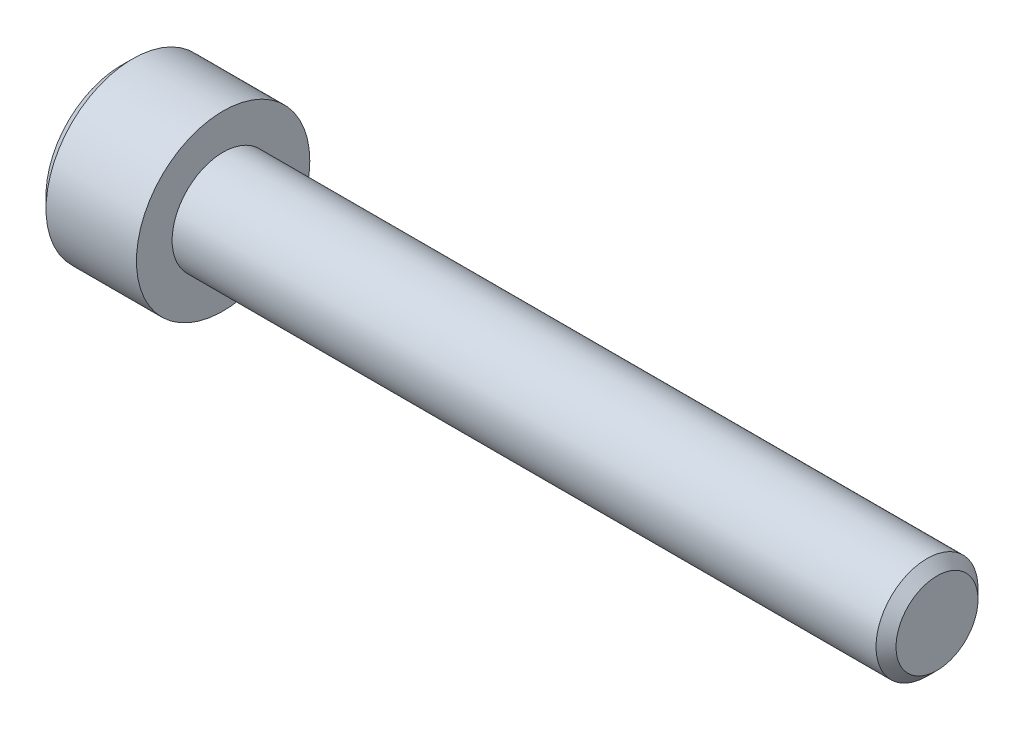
ISO-10303-21;
HEADER;
FILE_DESCRIPTION(('STEP AP214'),'2;1');
FILE_NAME('part.step','',(''),(''),'','','');
FILE_SCHEMA(('AUTOMOTIVE_DESIGN { 1 0 10303 214 1 1 1 1 }'));
ENDSEC;
DATA;
#1=APPLICATION_CONTEXT('core data for automotive mechanical design processes');
#2=APPLICATION_PROTOCOL_DEFINITION('international standard','automotive_design',2000,#1);
#3=PRODUCT_CONTEXT('',#1,'mechanical');
#4=PRODUCT('Part','Part','',(#3));
#5=PRODUCT_RELATED_PRODUCT_CATEGORY('part','',(#4));
#6=PRODUCT_DEFINITION_FORMATION('','',#4);
#7=PRODUCT_DEFINITION_CONTEXT('part definition',#1,'design');
#8=PRODUCT_DEFINITION('design','',#6,#7);
#9=PRODUCT_DEFINITION_SHAPE('','',#8);
#10=(LENGTH_UNIT() NAMED_UNIT(*) SI_UNIT(.MILLI.,.METRE.));
#11=(NAMED_UNIT(*) PLANE_ANGLE_UNIT() SI_UNIT($,.RADIAN.));
#12=(NAMED_UNIT(*) SI_UNIT($,.STERADIAN.) SOLID_ANGLE_UNIT());
#13=UNCERTAINTY_MEASURE_WITH_UNIT(LENGTH_MEASURE(1.E-05),#10,'distance_accuracy_value','');
#14=(GEOMETRIC_REPRESENTATION_CONTEXT(3) GLOBAL_UNCERTAINTY_ASSIGNED_CONTEXT((#13)) GLOBAL_UNIT_ASSIGNED_CONTEXT((#10,
#11,#12)) REPRESENTATION_CONTEXT('',''));
#15=CARTESIAN_POINT('',(0.,0.,0.));
#16=DIRECTION('',(0.,0.,1.));
#17=DIRECTION('',(1.,0.,0.));
#18=AXIS2_PLACEMENT_3D('',#15,#16,#17);
#19=CARTESIAN_POINT('',(-5.,0.,0.));
#20=DIRECTION('',(1.,0.,0.));
#21=DIRECTION('',(0.,0.,-1.));
#22=AXIS2_PLACEMENT_3D('',#19,#20,#21);
#23=PLANE('',#22);
#24=CARTESIAN_POINT('',(-5.,0.,0.));
#25=DIRECTION('',(1.,0.,0.));
#26=DIRECTION('',(0.,0.,-1.));
#27=AXIS2_PLACEMENT_3D('',#24,#25,#26);
#28=CIRCLE('',#27,3.68333333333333);
#29=CARTESIAN_POINT('',(-5.,0.,-3.68333333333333));
#30=VERTEX_POINT('',#29);
#31=EDGE_CURVE('E10',#30,#30,#28,.T.);
#32=ORIENTED_EDGE('',*,*,#31,.F.);
#33=EDGE_LOOP('',(#32));
#34=FACE_BOUND('',#33,.T.);
#35=DIRECTION('',(0.,0.5,-0.866025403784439));
#36=VECTOR('',#35,1.);
#37=CARTESIAN_POINT('',(-5.,-2.3094010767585,0.));
#38=LINE('',#37,#36);
#39=CARTESIAN_POINT('',(-5.,-2.3094010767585,0.));
#40=VERTEX_POINT('',#39);
#41=CARTESIAN_POINT('',(-5.,-1.15470053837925,-2.));
#42=VERTEX_POINT('',#41);
#43=EDGE_CURVE('E152',#40,#42,#38,.T.);
#44=ORIENTED_EDGE('',*,*,#43,.T.);
#45=DIRECTION('',(0.,1.,0.));
#46=VECTOR('',#45,1.);
#47=CARTESIAN_POINT('',(-5.,-1.15470053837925,-2.));
#48=LINE('',#47,#46);
#49=CARTESIAN_POINT('',(-5.,1.15470053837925,-2.));
#50=VERTEX_POINT('',#49);
#51=EDGE_CURVE('E154',#42,#50,#48,.T.);
#52=ORIENTED_EDGE('',*,*,#51,.T.);
#53=DIRECTION('',(0.,0.5,0.866025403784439));
#54=VECTOR('',#53,1.);
#55=CARTESIAN_POINT('',(-5.,1.15470053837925,-2.));
#56=LINE('',#55,#54);
#57=CARTESIAN_POINT('',(-5.,2.3094010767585,0.));
#58=VERTEX_POINT('',#57);
#59=EDGE_CURVE('E157',#50,#58,#56,.T.);
#60=ORIENTED_EDGE('',*,*,#59,.T.);
#61=DIRECTION('',(0.,-0.5,0.866025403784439));
#62=VECTOR('',#61,1.);
#63=CARTESIAN_POINT('',(-5.,2.3094010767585,0.));
#64=LINE('',#63,#62);
#65=CARTESIAN_POINT('',(-5.,1.15470053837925,2.));
#66=VERTEX_POINT('',#65);
#67=EDGE_CURVE('E99',#58,#66,#64,.T.);
#68=ORIENTED_EDGE('',*,*,#67,.T.);
#69=DIRECTION('',(0.,-1.,0.));
#70=VECTOR('',#69,1.);
#71=CARTESIAN_POINT('',(-5.,1.15470053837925,2.));
#72=LINE('',#71,#70);
#73=CARTESIAN_POINT('',(-5.,-1.15470053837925,2.));
#74=VERTEX_POINT('',#73);
#75=EDGE_CURVE('E159',#66,#74,#72,.T.);
#76=ORIENTED_EDGE('',*,*,#75,.T.);
#77=DIRECTION('',(0.,-0.5,-0.866025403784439));
#78=VECTOR('',#77,1.);
#79=CARTESIAN_POINT('',(-5.,-1.15470053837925,2.));
#80=LINE('',#79,#78);
#81=EDGE_CURVE('E114',#74,#40,#80,.T.);
#82=ORIENTED_EDGE('',*,*,#81,.T.);
#83=EDGE_LOOP('',(#44,#52,#60,#68,#76,#82));
#84=FACE_BOUND('',#83,.T.);
#85=ADVANCED_FACE('F16',(#34,#84),#23,.F.);
#86=CARTESIAN_POINT('',(-5.,0.,0.));
#87=DIRECTION('',(1.,0.,0.));
#88=DIRECTION('',(0.,0.,-1.));
#89=AXIS2_PLACEMENT_3D('',#86,#87,#88);
#90=CONICAL_SURFACE('',#89,3.68333333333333,0.785398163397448);
#91=CARTESIAN_POINT('',(-4.43333333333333,0.,0.));
#92=DIRECTION('',(1.,0.,0.));
#93=DIRECTION('',(0.,0.,-1.));
#94=AXIS2_PLACEMENT_3D('',#91,#92,#93);
#95=CIRCLE('',#94,4.25);
#96=CARTESIAN_POINT('',(-4.43333333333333,0.,-4.25));
#97=VERTEX_POINT('',#96);
#98=EDGE_CURVE('E23',#97,#97,#95,.T.);
#99=ORIENTED_EDGE('',*,*,#98,.F.);
#100=EDGE_LOOP('',(#99));
#101=FACE_BOUND('',#100,.T.);
#102=ORIENTED_EDGE('',*,*,#31,.T.);
#103=EDGE_LOOP('',(#102));
#104=FACE_BOUND('',#103,.T.);
#105=ADVANCED_FACE('F143',(#101,#104),#90,.T.);
#106=CARTESIAN_POINT('',(35.,0.,0.));
#107=DIRECTION('',(1.,0.,0.));
#108=DIRECTION('',(0.,0.,-1.));
#109=AXIS2_PLACEMENT_3D('',#106,#107,#108);
#110=CYLINDRICAL_SURFACE('',#109,4.25);
#111=CARTESIAN_POINT('',(0.,0.,0.));
#112=DIRECTION('',(1.,0.,0.));
#113=DIRECTION('',(0.,0.,-1.));
#114=AXIS2_PLACEMENT_3D('',#111,#112,#113);
#115=CIRCLE('',#114,4.25);
#116=CARTESIAN_POINT('',(0.,0.,-4.25));
#117=VERTEX_POINT('',#116);
#118=EDGE_CURVE('E136',#117,#117,#115,.T.);
#119=ORIENTED_EDGE('',*,*,#118,.F.);
#120=EDGE_LOOP('',(#119));
#121=FACE_BOUND('',#120,.T.);
#122=ORIENTED_EDGE('',*,*,#98,.T.);
#123=EDGE_LOOP('',(#122));
#124=FACE_BOUND('',#123,.T.);
#125=ADVANCED_FACE('F141',(#121,#124),#110,.T.);
#126=CARTESIAN_POINT('',(0.,4.25,0.));
#127=DIRECTION('',(-1.,0.,0.));
#128=DIRECTION('',(0.,0.,1.));
#129=AXIS2_PLACEMENT_3D('',#126,#127,#128);
#130=PLANE('',#129);
#131=CARTESIAN_POINT('',(0.,0.,0.));
#132=DIRECTION('',(1.,0.,0.));
#133=DIRECTION('',(0.,0.,-1.));
#134=AXIS2_PLACEMENT_3D('',#131,#132,#133);
#135=CIRCLE('',#134,2.5);
#136=CARTESIAN_POINT('',(0.,0.,-2.5));
#137=VERTEX_POINT('',#136);
#138=EDGE_CURVE('E133',#137,#137,#135,.T.);
#139=ORIENTED_EDGE('',*,*,#138,.F.);
#140=EDGE_LOOP('',(#139));
#141=FACE_BOUND('',#140,.T.);
#142=ORIENTED_EDGE('',*,*,#118,.T.);
#143=EDGE_LOOP('',(#142));
#144=FACE_BOUND('',#143,.T.);
#145=ADVANCED_FACE('F250',(#141,#144),#130,.F.);
#146=CARTESIAN_POINT('',(35.,0.,0.));
#147=DIRECTION('',(1.,0.,0.));
#148=DIRECTION('',(0.,0.,-1.));
#149=AXIS2_PLACEMENT_3D('',#146,#147,#148);
#150=CYLINDRICAL_SURFACE('',#149,2.5);
#151=CARTESIAN_POINT('',(34.5095,0.,0.));
#152=DIRECTION('',(1.,0.,0.));
#153=DIRECTION('',(0.,0.,-1.));
#154=AXIS2_PLACEMENT_3D('',#151,#152,#153);
#155=CIRCLE('',#154,2.5);
#156=CARTESIAN_POINT('',(34.5095,0.,-2.5));
#157=VERTEX_POINT('',#156);
#158=EDGE_CURVE('E130',#157,#157,#155,.T.);
#159=ORIENTED_EDGE('',*,*,#158,.F.);
#160=EDGE_LOOP('',(#159));
#161=FACE_BOUND('',#160,.T.);
#162=ORIENTED_EDGE('',*,*,#138,.T.);
#163=EDGE_LOOP('',(#162));
#164=FACE_BOUND('',#163,.T.);
#165=ADVANCED_FACE('F246',(#161,#164),#150,.T.);
#166=CARTESIAN_POINT('',(34.5095,0.,0.));
#167=DIRECTION('',(-1.,0.,0.));
#168=DIRECTION('',(0.,0.,1.));
#169=AXIS2_PLACEMENT_3D('',#166,#167,#168);
#170=CONICAL_SURFACE('',#169,2.5,0.78539816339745);
#171=CARTESIAN_POINT('',(35.,0.,0.));
#172=DIRECTION('',(1.,0.,0.));
#173=DIRECTION('',(0.,0.,-1.));
#174=AXIS2_PLACEMENT_3D('',#171,#172,#173);
#175=CIRCLE('',#174,2.0095);
#176=CARTESIAN_POINT('',(35.,0.,-2.0095));
#177=VERTEX_POINT('',#176);
#178=EDGE_CURVE('E126',#177,#177,#175,.T.);
#179=ORIENTED_EDGE('',*,*,#178,.F.);
#180=EDGE_LOOP('',(#179));
#181=FACE_BOUND('',#180,.T.);
#182=ORIENTED_EDGE('',*,*,#158,.T.);
#183=EDGE_LOOP('',(#182));
#184=FACE_BOUND('',#183,.T.);
#185=ADVANCED_FACE('F242',(#181,#184),#170,.T.);
#186=CARTESIAN_POINT('',(35.,2.0095,0.));
#187=DIRECTION('',(-1.,0.,0.));
#188=DIRECTION('',(0.,0.,1.));
#189=AXIS2_PLACEMENT_3D('',#186,#187,#188);
#190=PLANE('',#189);
#191=ORIENTED_EDGE('',*,*,#178,.T.);
#192=EDGE_LOOP('',(#191));
#193=FACE_BOUND('',#192,.T.);
#194=ADVANCED_FACE('F237',(#193),#190,.F.);
#195=CARTESIAN_POINT('',(-2.5,1.15470053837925,2.));
#196=DIRECTION('',(0.,0.,-1.));
#197=DIRECTION('',(-1.,0.,0.));
#198=AXIS2_PLACEMENT_3D('',#195,#196,#197);
#199=PLANE('',#198);
#200=ORIENTED_EDGE('',*,*,#75,.F.);
#201=DIRECTION('',(-1.,0.,0.));
#202=VECTOR('',#201,1.);
#203=CARTESIAN_POINT('',(-2.5,1.15470053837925,2.));
#204=LINE('',#203,#202);
#205=CARTESIAN_POINT('',(-2.5,1.15470053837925,2.));
#206=VERTEX_POINT('',#205);
#207=EDGE_CURVE('E166',#206,#66,#204,.T.);
#208=ORIENTED_EDGE('',*,*,#207,.F.);
#209=DIRECTION('',(0.,-1.,0.));
#210=VECTOR('',#209,1.);
#211=CARTESIAN_POINT('',(-2.5,1.15470053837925,2.));
#212=LINE('',#211,#210);
#213=CARTESIAN_POINT('',(-2.5,0.,2.));
#214=VERTEX_POINT('',#213);
#215=EDGE_CURVE('E96',#206,#214,#212,.T.);
#216=ORIENTED_EDGE('',*,*,#215,.T.);
#217=CARTESIAN_POINT('',(-2.5,-1.15470053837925,2.));
#218=VERTEX_POINT('',#217);
#219=EDGE_CURVE('E88',#214,#218,#212,.T.);
#220=ORIENTED_EDGE('',*,*,#219,.T.);
#221=DIRECTION('',(-1.,0.,0.));
#222=VECTOR('',#221,1.);
#223=CARTESIAN_POINT('',(-2.5,-1.15470053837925,2.));
#224=LINE('',#223,#222);
#225=EDGE_CURVE('E92',#218,#74,#224,.T.);
#226=ORIENTED_EDGE('',*,*,#225,.T.);
#227=EDGE_LOOP('',(#200,#208,#216,#220,#226));
#228=FACE_BOUND('',#227,.T.);
#229=ADVANCED_FACE('F90',(#228),#199,.T.);
#230=CARTESIAN_POINT('',(-2.5,-1.15470053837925,2.));
#231=DIRECTION('',(0.,0.866025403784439,-0.5));
#232=DIRECTION('',(0.,0.5,0.866025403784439));
#233=AXIS2_PLACEMENT_3D('',#230,#231,#232);
#234=PLANE('',#233);
#235=ORIENTED_EDGE('',*,*,#81,.F.);
#236=ORIENTED_EDGE('',*,*,#225,.F.);
#237=DIRECTION('',(0.,-0.5,-0.866025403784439));
#238=VECTOR('',#237,1.);
#239=CARTESIAN_POINT('',(-2.5,-1.15470053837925,2.));
#240=LINE('',#239,#238);
#241=CARTESIAN_POINT('',(-2.5,-1.73205080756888,1.));
#242=VERTEX_POINT('',#241);
#243=EDGE_CURVE('E102',#218,#242,#240,.T.);
#244=ORIENTED_EDGE('',*,*,#243,.T.);
#245=CARTESIAN_POINT('',(-2.5,-2.3094010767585,0.));
#246=VERTEX_POINT('',#245);
#247=EDGE_CURVE('E109',#242,#246,#240,.T.);
#248=ORIENTED_EDGE('',*,*,#247,.T.);
#249=DIRECTION('',(-1.,0.,0.));
#250=VECTOR('',#249,1.);
#251=CARTESIAN_POINT('',(-2.5,-2.3094010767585,0.));
#252=LINE('',#251,#250);
#253=EDGE_CURVE('E116',#246,#40,#252,.T.);
#254=ORIENTED_EDGE('',*,*,#253,.T.);
#255=EDGE_LOOP('',(#235,#236,#244,#248,#254));
#256=FACE_BOUND('',#255,.T.);
#257=ADVANCED_FACE('F111',(#256),#234,.T.);
#258=CARTESIAN_POINT('',(-2.5,-2.3094010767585,0.));
#259=DIRECTION('',(0.,0.866025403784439,0.5));
#260=DIRECTION('',(0.,-0.5,0.866025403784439));
#261=AXIS2_PLACEMENT_3D('',#258,#259,#260);
#262=PLANE('',#261);
#263=ORIENTED_EDGE('',*,*,#43,.F.);
#264=ORIENTED_EDGE('',*,*,#253,.F.);
#265=DIRECTION('',(0.,0.5,-0.866025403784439));
#266=VECTOR('',#265,1.);
#267=CARTESIAN_POINT('',(-2.5,-2.3094010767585,0.));
#268=LINE('',#267,#266);
#269=CARTESIAN_POINT('',(-2.5,-1.73205080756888,-1.));
#270=VERTEX_POINT('',#269);
#271=EDGE_CURVE('E30',#246,#270,#268,.T.);
#272=ORIENTED_EDGE('',*,*,#271,.T.);
#273=CARTESIAN_POINT('',(-2.5,-1.15470053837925,-2.));
#274=VERTEX_POINT('',#273);
#275=EDGE_CURVE('E108',#270,#274,#268,.T.);
#276=ORIENTED_EDGE('',*,*,#275,.T.);
#277=DIRECTION('',(-1.,0.,0.));
#278=VECTOR('',#277,1.);
#279=CARTESIAN_POINT('',(-2.5,-1.15470053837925,-2.));
#280=LINE('',#279,#278);
#281=EDGE_CURVE('E122',#274,#42,#280,.T.);
#282=ORIENTED_EDGE('',*,*,#281,.T.);
#283=EDGE_LOOP('',(#263,#264,#272,#276,#282));
#284=FACE_BOUND('',#283,.T.);
#285=ADVANCED_FACE('F176',(#284),#262,.T.);
#286=CARTESIAN_POINT('',(-2.5,-1.15470053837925,-2.));
#287=DIRECTION('',(0.,0.,1.));
#288=DIRECTION('',(1.,0.,0.));
#289=AXIS2_PLACEMENT_3D('',#286,#287,#288);
#290=PLANE('',#289);
#291=ORIENTED_EDGE('',*,*,#51,.F.);
#292=ORIENTED_EDGE('',*,*,#281,.F.);
#293=DIRECTION('',(0.,1.,0.));
#294=VECTOR('',#293,1.);
#295=CARTESIAN_POINT('',(-2.5,-1.15470053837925,-2.));
#296=LINE('',#295,#294);
#297=CARTESIAN_POINT('',(-2.5,0.,-2.));
#298=VERTEX_POINT('',#297);
#299=EDGE_CURVE('E181',#274,#298,#296,.T.);
#300=ORIENTED_EDGE('',*,*,#299,.T.);
#301=CARTESIAN_POINT('',(-2.5,1.15470053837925,-2.));
#302=VERTEX_POINT('',#301);
#303=EDGE_CURVE('E189',#298,#302,#296,.T.);
#304=ORIENTED_EDGE('',*,*,#303,.T.);
#305=DIRECTION('',(-1.,0.,0.));
#306=VECTOR('',#305,1.);
#307=CARTESIAN_POINT('',(-2.5,1.15470053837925,-2.));
#308=LINE('',#307,#306);
#309=EDGE_CURVE('E173',#302,#50,#308,.T.);
#310=ORIENTED_EDGE('',*,*,#309,.T.);
#311=EDGE_LOOP('',(#291,#292,#300,#304,#310));
#312=FACE_BOUND('',#311,.T.);
#313=ADVANCED_FACE('F180',(#312),#290,.T.);
#314=CARTESIAN_POINT('',(-2.5,1.15470053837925,-2.));
#315=DIRECTION('',(0.,-0.866025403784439,0.5));
#316=DIRECTION('',(0.,-0.5,-0.866025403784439));
#317=AXIS2_PLACEMENT_3D('',#314,#315,#316);
#318=PLANE('',#317);
#319=ORIENTED_EDGE('',*,*,#59,.F.);
#320=ORIENTED_EDGE('',*,*,#309,.F.);
#321=DIRECTION('',(0.,0.5,0.866025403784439));
#322=VECTOR('',#321,1.);
#323=CARTESIAN_POINT('',(-2.5,1.15470053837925,-2.));
#324=LINE('',#323,#322);
#325=CARTESIAN_POINT('',(-2.5,1.73205080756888,-1.));
#326=VERTEX_POINT('',#325);
#327=EDGE_CURVE('E191',#302,#326,#324,.T.);
#328=ORIENTED_EDGE('',*,*,#327,.T.);
#329=CARTESIAN_POINT('',(-2.5,2.3094010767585,0.));
#330=VERTEX_POINT('',#329);
#331=EDGE_CURVE('E188',#326,#330,#324,.T.);
#332=ORIENTED_EDGE('',*,*,#331,.T.);
#333=DIRECTION('',(-1.,0.,0.));
#334=VECTOR('',#333,1.);
#335=CARTESIAN_POINT('',(-2.5,2.3094010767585,0.));
#336=LINE('',#335,#334);
#337=EDGE_CURVE('E169',#330,#58,#336,.T.);
#338=ORIENTED_EDGE('',*,*,#337,.T.);
#339=EDGE_LOOP('',(#319,#320,#328,#332,#338));
#340=FACE_BOUND('',#339,.T.);
#341=ADVANCED_FACE('F219',(#340),#318,.T.);
#342=CARTESIAN_POINT('',(-2.5,2.3094010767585,0.));
#343=DIRECTION('',(0.,-0.866025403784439,-0.5));
#344=DIRECTION('',(0.,0.5,-0.866025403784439));
#345=AXIS2_PLACEMENT_3D('',#342,#343,#344);
#346=PLANE('',#345);
#347=ORIENTED_EDGE('',*,*,#67,.F.);
#348=ORIENTED_EDGE('',*,*,#337,.F.);
#349=DIRECTION('',(0.,-0.5,0.866025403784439));
#350=VECTOR('',#349,1.);
#351=CARTESIAN_POINT('',(-2.5,2.3094010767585,0.));
#352=LINE('',#351,#350);
#353=CARTESIAN_POINT('',(-2.5,1.73205080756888,1.));
#354=VERTEX_POINT('',#353);
#355=EDGE_CURVE('E170',#330,#354,#352,.T.);
#356=ORIENTED_EDGE('',*,*,#355,.T.);
#357=EDGE_CURVE('E196',#354,#206,#352,.T.);
#358=ORIENTED_EDGE('',*,*,#357,.T.);
#359=ORIENTED_EDGE('',*,*,#207,.T.);
#360=EDGE_LOOP('',(#347,#348,#356,#358,#359));
#361=FACE_BOUND('',#360,.T.);
#362=ADVANCED_FACE('F199',(#361),#346,.T.);
#363=CARTESIAN_POINT('',(-2.5,0.,0.));
#364=DIRECTION('',(1.,0.,0.));
#365=DIRECTION('',(0.,0.,-1.));
#366=AXIS2_PLACEMENT_3D('',#363,#364,#365);
#367=PLANE('',#366);
#368=CARTESIAN_POINT('',(-2.5,0.,0.));
#369=DIRECTION('',(1.,0.,0.));
#370=DIRECTION('',(0.,0.,-1.));
#371=AXIS2_PLACEMENT_3D('',#368,#369,#370);
#372=CIRCLE('',#371,2.);
#373=EDGE_CURVE('E115',#298,#326,#372,.T.);
#374=ORIENTED_EDGE('',*,*,#373,.T.);
#375=ORIENTED_EDGE('',*,*,#327,.F.);
#376=ORIENTED_EDGE('',*,*,#303,.F.);
#377=EDGE_LOOP('',(#374,#375,#376));
#378=FACE_BOUND('',#377,.T.);
#379=ADVANCED_FACE('F214',(#378),#367,.F.);
#380=ORIENTED_EDGE('',*,*,#331,.F.);
#381=EDGE_CURVE('E121',#326,#354,#372,.T.);
#382=ORIENTED_EDGE('',*,*,#381,.T.);
#383=ORIENTED_EDGE('',*,*,#355,.F.);
#384=EDGE_LOOP('',(#380,#382,#383));
#385=FACE_BOUND('',#384,.T.);
#386=ADVANCED_FACE('F216',(#385),#367,.F.);
#387=EDGE_CURVE('E127',#354,#214,#372,.T.);
#388=ORIENTED_EDGE('',*,*,#387,.T.);
#389=ORIENTED_EDGE('',*,*,#215,.F.);
#390=ORIENTED_EDGE('',*,*,#357,.F.);
#391=EDGE_LOOP('',(#388,#389,#390));
#392=FACE_BOUND('',#391,.T.);
#393=ADVANCED_FACE('F205',(#392),#367,.F.);
#394=EDGE_CURVE('E104',#214,#242,#372,.T.);
#395=ORIENTED_EDGE('',*,*,#394,.T.);
#396=ORIENTED_EDGE('',*,*,#243,.F.);
#397=ORIENTED_EDGE('',*,*,#219,.F.);
#398=EDGE_LOOP('',(#395,#396,#397));
#399=FACE_BOUND('',#398,.T.);
#400=ADVANCED_FACE('F103',(#399),#367,.F.);
#401=EDGE_CURVE('E208',#242,#270,#372,.T.);
#402=ORIENTED_EDGE('',*,*,#401,.T.);
#403=ORIENTED_EDGE('',*,*,#271,.F.);
#404=ORIENTED_EDGE('',*,*,#247,.F.);
#405=EDGE_LOOP('',(#402,#403,#404));
#406=FACE_BOUND('',#405,.T.);
#407=ADVANCED_FACE('F207',(#406),#367,.F.);
#408=EDGE_CURVE('E119',#270,#298,#372,.T.);
#409=ORIENTED_EDGE('',*,*,#408,.T.);
#410=ORIENTED_EDGE('',*,*,#299,.F.);
#411=ORIENTED_EDGE('',*,*,#275,.F.);
#412=EDGE_LOOP('',(#409,#410,#411));
#413=FACE_BOUND('',#412,.T.);
#414=ADVANCED_FACE('F184',(#413),#367,.F.);
#415=CARTESIAN_POINT('',(-2.5,0.,0.));
#416=DIRECTION('',(-1.,0.,0.));
#417=DIRECTION('',(0.,0.,1.));
#418=AXIS2_PLACEMENT_3D('',#415,#416,#417);
#419=CONICAL_SURFACE('',#418,2.,1.30899693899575);
#420=CARTESIAN_POINT('',(-1.96410161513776,0.,0.));
#421=VERTEX_POINT('',#420);
#422=VERTEX_LOOP('',#421);
#423=FACE_BOUND('',#422,.T.);
#424=ORIENTED_EDGE('',*,*,#381,.F.);
#425=ORIENTED_EDGE('',*,*,#373,.F.);
#426=ORIENTED_EDGE('',*,*,#408,.F.);
#427=ORIENTED_EDGE('',*,*,#401,.F.);
#428=ORIENTED_EDGE('',*,*,#394,.F.);
#429=ORIENTED_EDGE('',*,*,#387,.F.);
#430=EDGE_LOOP('',(#424,#425,#426,#427,#428,#429));
#431=FACE_BOUND('',#430,.T.);
#432=ADVANCED_FACE('F210',(#423,#431),#419,.F.);
#433=CLOSED_SHELL('',(#85,#105,#125,#145,#165,#185,#194,#229,#257,#285,#313,#341,#362,#379,#386,
#393,#400,#407,#414,#432));
#434=MANIFOLD_SOLID_BREP('B1',#433);
#435=ADVANCED_BREP_SHAPE_REPRESENTATION('',(#18,#434),#14);
#436=SHAPE_DEFINITION_REPRESENTATION(#9,#435);
ENDSEC;
END-ISO-10303-21;
